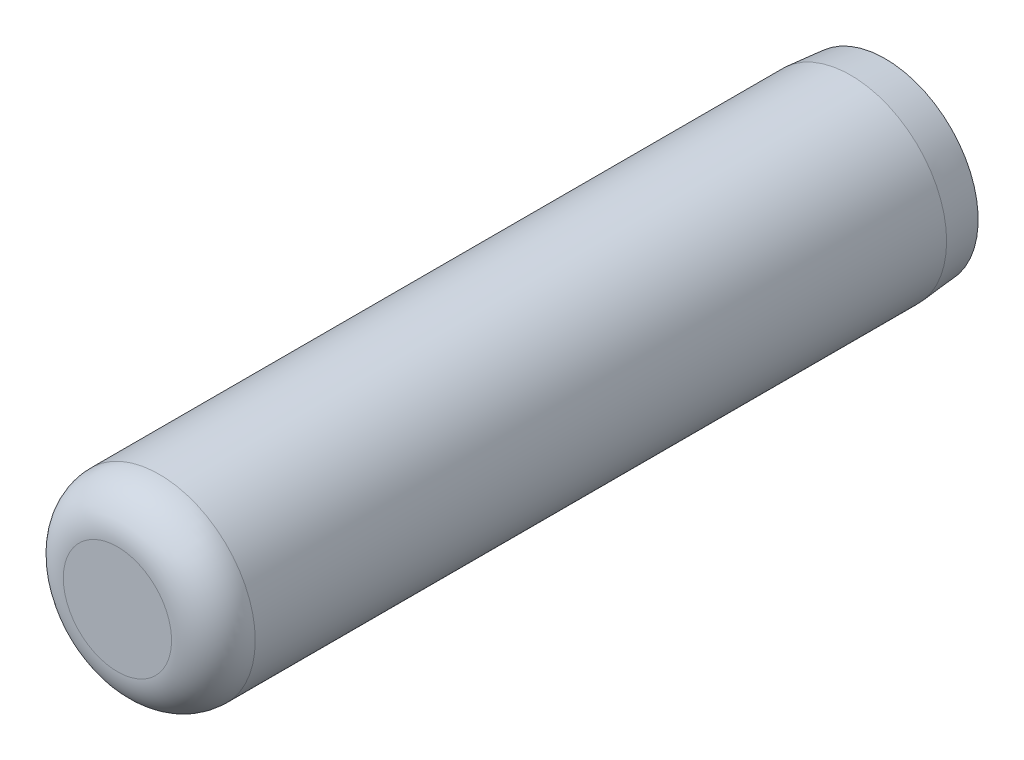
ISO-10303-21;
HEADER;
FILE_DESCRIPTION(('STEP AP214'),'2;1');
FILE_NAME('part.step','',(''),(''),'','','');
FILE_SCHEMA(('AUTOMOTIVE_DESIGN { 1 0 10303 214 1 1 1 1 }'));
ENDSEC;
DATA;
#1=APPLICATION_CONTEXT('core data for automotive mechanical design processes');
#2=APPLICATION_PROTOCOL_DEFINITION('international standard','automotive_design',2000,#1);
#3=PRODUCT_CONTEXT('',#1,'mechanical');
#4=PRODUCT('Part','Part','',(#3));
#5=PRODUCT_RELATED_PRODUCT_CATEGORY('part','',(#4));
#6=PRODUCT_DEFINITION_FORMATION('','',#4);
#7=PRODUCT_DEFINITION_CONTEXT('part definition',#1,'design');
#8=PRODUCT_DEFINITION('design','',#6,#7);
#9=PRODUCT_DEFINITION_SHAPE('','',#8);
#10=(LENGTH_UNIT() NAMED_UNIT(*) SI_UNIT(.MILLI.,.METRE.));
#11=(NAMED_UNIT(*) PLANE_ANGLE_UNIT() SI_UNIT($,.RADIAN.));
#12=(NAMED_UNIT(*) SI_UNIT($,.STERADIAN.) SOLID_ANGLE_UNIT());
#13=UNCERTAINTY_MEASURE_WITH_UNIT(LENGTH_MEASURE(1.E-05),#10,'distance_accuracy_value','');
#14=(GEOMETRIC_REPRESENTATION_CONTEXT(3) GLOBAL_UNCERTAINTY_ASSIGNED_CONTEXT((#13)) GLOBAL_UNIT_ASSIGNED_CONTEXT((#10,
#11,#12)) REPRESENTATION_CONTEXT('',''));
#15=CARTESIAN_POINT('',(0.,0.,0.));
#16=DIRECTION('',(0.,0.,1.));
#17=DIRECTION('',(1.,0.,0.));
#18=AXIS2_PLACEMENT_3D('',#15,#16,#17);
#19=CARTESIAN_POINT('',(0.,0.,22.6314));
#20=DIRECTION('',(0.,0.,-1.));
#21=DIRECTION('',(-1.,0.,0.));
#22=AXIS2_PLACEMENT_3D('',#19,#20,#21);
#23=TOROIDAL_SURFACE('',#22,3.5814,2.7686);
#24=CARTESIAN_POINT('',(0.,0.,22.6314));
#25=DIRECTION('',(0.,0.,-1.));
#26=DIRECTION('',(-1.,0.,0.));
#27=AXIS2_PLACEMENT_3D('',#24,#25,#26);
#28=CIRCLE('',#27,6.35);
#29=CARTESIAN_POINT('',(-6.35000000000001,0.,22.6314));
#30=VERTEX_POINT('',#29);
#31=EDGE_CURVE('E10',#30,#30,#28,.T.);
#32=ORIENTED_EDGE('',*,*,#31,.F.);
#33=EDGE_LOOP('',(#32));
#34=FACE_BOUND('',#33,.T.);
#35=CARTESIAN_POINT('',(0.,0.,25.4));
#36=DIRECTION('',(0.,0.,-1.));
#37=DIRECTION('',(-1.,0.,0.));
#38=AXIS2_PLACEMENT_3D('',#35,#36,#37);
#39=CIRCLE('',#38,3.5814);
#40=CARTESIAN_POINT('',(-3.58140000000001,0.,25.4));
#41=VERTEX_POINT('',#40);
#42=EDGE_CURVE('E60',#41,#41,#39,.T.);
#43=ORIENTED_EDGE('',*,*,#42,.T.);
#44=EDGE_LOOP('',(#43));
#45=FACE_BOUND('',#44,.T.);
#46=ADVANCED_FACE('F41',(#34,#45),#23,.T.);
#47=CARTESIAN_POINT('',(0.,0.,-47.5372037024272));
#48=DIRECTION('',(0.,0.,-1.));
#49=DIRECTION('',(-1.,0.,0.));
#50=AXIS2_PLACEMENT_3D('',#47,#48,#49);
#51=CYLINDRICAL_SURFACE('',#50,6.35);
#52=CARTESIAN_POINT('',(0.,0.,-23.114));
#53=DIRECTION('',(0.,0.,-1.));
#54=DIRECTION('',(-1.,0.,0.));
#55=AXIS2_PLACEMENT_3D('',#52,#53,#54);
#56=CIRCLE('',#55,6.35);
#57=CARTESIAN_POINT('',(-6.35,0.,-23.114));
#58=VERTEX_POINT('',#57);
#59=EDGE_CURVE('E48',#58,#58,#56,.T.);
#60=ORIENTED_EDGE('',*,*,#59,.F.);
#61=EDGE_LOOP('',(#60));
#62=FACE_BOUND('',#61,.T.);
#63=ORIENTED_EDGE('',*,*,#31,.T.);
#64=EDGE_LOOP('',(#63));
#65=FACE_BOUND('',#64,.T.);
#66=ADVANCED_FACE('F80',(#62,#65),#51,.T.);
#67=CARTESIAN_POINT('',(0.,0.,-23.114));
#68=DIRECTION('',(0.,0.,1.));
#69=DIRECTION('',(1.,0.,0.));
#70=AXIS2_PLACEMENT_3D('',#67,#68,#69);
#71=CONICAL_SURFACE('',#70,6.35,0.0872664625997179);
#72=CARTESIAN_POINT('',(0.,0.,-25.4));
#73=DIRECTION('',(0.,0.,-1.));
#74=DIRECTION('',(-1.,0.,0.));
#75=AXIS2_PLACEMENT_3D('',#72,#73,#74);
#76=CIRCLE('',#75,6.15000091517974);
#77=CARTESIAN_POINT('',(-6.15000091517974,0.,-25.4));
#78=VERTEX_POINT('',#77);
#79=EDGE_CURVE('E54',#78,#78,#76,.T.);
#80=ORIENTED_EDGE('',*,*,#79,.F.);
#81=EDGE_LOOP('',(#80));
#82=FACE_BOUND('',#81,.T.);
#83=ORIENTED_EDGE('',*,*,#59,.T.);
#84=EDGE_LOOP('',(#83));
#85=FACE_BOUND('',#84,.T.);
#86=ADVANCED_FACE('F76',(#82,#85),#71,.T.);
#87=CARTESIAN_POINT('',(0.,0.,-25.4));
#88=DIRECTION('',(0.,0.,1.));
#89=DIRECTION('',(1.,0.,0.));
#90=AXIS2_PLACEMENT_3D('',#87,#88,#89);
#91=PLANE('',#90);
#92=ORIENTED_EDGE('',*,*,#79,.T.);
#93=EDGE_LOOP('',(#92));
#94=FACE_BOUND('',#93,.T.);
#95=ADVANCED_FACE('F71',(#94),#91,.F.);
#96=CARTESIAN_POINT('',(0.,0.,25.4));
#97=DIRECTION('',(0.,0.,-1.));
#98=DIRECTION('',(-1.,0.,0.));
#99=AXIS2_PLACEMENT_3D('',#96,#97,#98);
#100=PLANE('',#99);
#101=ORIENTED_EDGE('',*,*,#42,.F.);
#102=EDGE_LOOP('',(#101));
#103=FACE_BOUND('',#102,.T.);
#104=ADVANCED_FACE('F69',(#103),#100,.F.);
#105=CLOSED_SHELL('',(#46,#66,#86,#95,#104));
#106=MANIFOLD_SOLID_BREP('B2',#105);
#107=ADVANCED_BREP_SHAPE_REPRESENTATION('',(#18,#106),#14);
#108=SHAPE_DEFINITION_REPRESENTATION(#9,#107);
ENDSEC;
END-ISO-10303-21;
